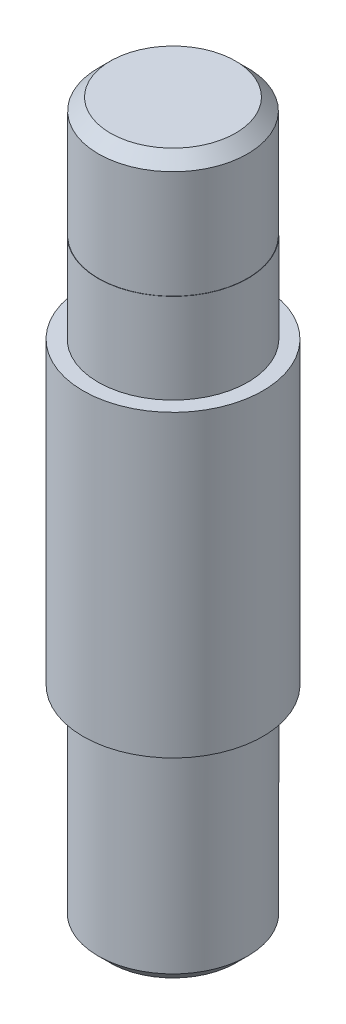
ISO-10303-21;
HEADER;
FILE_DESCRIPTION(('STEP AP214'),'2;1');
FILE_NAME('part.step','',(''),(''),'','','');
FILE_SCHEMA(('AUTOMOTIVE_DESIGN { 1 0 10303 214 1 1 1 1 }'));
ENDSEC;
DATA;
#1=APPLICATION_CONTEXT('core data for automotive mechanical design processes');
#2=APPLICATION_PROTOCOL_DEFINITION('international standard','automotive_design',2000,#1);
#3=PRODUCT_CONTEXT('',#1,'mechanical');
#4=PRODUCT('Part','Part','',(#3));
#5=PRODUCT_RELATED_PRODUCT_CATEGORY('part','',(#4));
#6=PRODUCT_DEFINITION_FORMATION('','',#4);
#7=PRODUCT_DEFINITION_CONTEXT('part definition',#1,'design');
#8=PRODUCT_DEFINITION('design','',#6,#7);
#9=PRODUCT_DEFINITION_SHAPE('','',#8);
#10=(LENGTH_UNIT() NAMED_UNIT(*) SI_UNIT(.MILLI.,.METRE.));
#11=(NAMED_UNIT(*) PLANE_ANGLE_UNIT() SI_UNIT($,.RADIAN.));
#12=(NAMED_UNIT(*) SI_UNIT($,.STERADIAN.) SOLID_ANGLE_UNIT());
#13=UNCERTAINTY_MEASURE_WITH_UNIT(LENGTH_MEASURE(1.E-05),#10,'distance_accuracy_value','');
#14=(GEOMETRIC_REPRESENTATION_CONTEXT(3) GLOBAL_UNCERTAINTY_ASSIGNED_CONTEXT((#13)) GLOBAL_UNIT_ASSIGNED_CONTEXT((#10,
#11,#12)) REPRESENTATION_CONTEXT('',''));
#15=CARTESIAN_POINT('',(0.,0.,0.));
#16=DIRECTION('',(0.,0.,1.));
#17=DIRECTION('',(1.,0.,0.));
#18=AXIS2_PLACEMENT_3D('',#15,#16,#17);
#19=CARTESIAN_POINT('',(0.,0.,0.));
#20=DIRECTION('',(0.,1.,0.));
#21=DIRECTION('',(0.,0.,1.));
#22=AXIS2_PLACEMENT_3D('',#19,#20,#21);
#23=PLANE('',#22);
#24=CARTESIAN_POINT('',(0.,0.,0.));
#25=DIRECTION('',(0.,1.,0.));
#26=DIRECTION('',(0.,0.,1.));
#27=AXIS2_PLACEMENT_3D('',#24,#25,#26);
#28=CIRCLE('',#27,3.);
#29=CARTESIAN_POINT('',(0.,0.,3.));
#30=VERTEX_POINT('',#29);
#31=EDGE_CURVE('E56',#30,#30,#28,.T.);
#32=ORIENTED_EDGE('',*,*,#31,.F.);
#33=EDGE_LOOP('',(#32));
#34=FACE_BOUND('',#33,.T.);
#35=CARTESIAN_POINT('',(0.,0.,0.));
#36=DIRECTION('',(0.,1.,0.));
#37=DIRECTION('',(0.,0.,1.));
#38=AXIS2_PLACEMENT_3D('',#35,#36,#37);
#39=CIRCLE('',#38,2.5);
#40=CARTESIAN_POINT('',(0.,0.,2.5));
#41=VERTEX_POINT('',#40);
#42=EDGE_CURVE('E50',#41,#41,#39,.F.);
#43=ORIENTED_EDGE('',*,*,#42,.F.);
#44=EDGE_LOOP('',(#43));
#45=FACE_BOUND('',#44,.T.);
#46=ADVANCED_FACE('F30',(#34,#45),#23,.F.);
#47=CARTESIAN_POINT('',(0.,13.,0.));
#48=DIRECTION('',(0.,1.,0.));
#49=DIRECTION('',(0.,0.,1.));
#50=AXIS2_PLACEMENT_3D('',#47,#48,#49);
#51=PLANE('',#50);
#52=CARTESIAN_POINT('',(0.,13.,0.));
#53=DIRECTION('',(0.,1.,0.));
#54=DIRECTION('',(0.,0.,1.));
#55=AXIS2_PLACEMENT_3D('',#52,#53,#54);
#56=CIRCLE('',#55,2.5);
#57=CARTESIAN_POINT('',(0.,13.,2.5));
#58=VERTEX_POINT('',#57);
#59=EDGE_CURVE('E59',#58,#58,#56,.T.);
#60=ORIENTED_EDGE('',*,*,#59,.T.);
#61=EDGE_LOOP('',(#60));
#62=FACE_BOUND('',#61,.T.);
#63=CARTESIAN_POINT('',(0.,13.,0.));
#64=DIRECTION('',(0.,1.,0.));
#65=DIRECTION('',(0.,0.,1.));
#66=AXIS2_PLACEMENT_3D('',#63,#64,#65);
#67=CIRCLE('',#66,2.49);
#68=CARTESIAN_POINT('',(0.,13.,2.49));
#69=VERTEX_POINT('',#68);
#70=EDGE_CURVE('E65',#69,#69,#67,.T.);
#71=ORIENTED_EDGE('',*,*,#70,.F.);
#72=EDGE_LOOP('',(#71));
#73=FACE_BOUND('',#72,.T.);
#74=ADVANCED_FACE('F71',(#62,#73),#51,.T.);
#75=CARTESIAN_POINT('',(0.,10.,0.));
#76=DIRECTION('',(0.,1.,0.));
#77=DIRECTION('',(0.,0.,1.));
#78=AXIS2_PLACEMENT_3D('',#75,#76,#77);
#79=PLANE('',#78);
#80=CARTESIAN_POINT('',(0.,10.,0.));
#81=DIRECTION('',(0.,1.,0.));
#82=DIRECTION('',(0.,0.,1.));
#83=AXIS2_PLACEMENT_3D('',#80,#81,#82);
#84=CIRCLE('',#83,3.);
#85=CARTESIAN_POINT('',(0.,10.,3.));
#86=VERTEX_POINT('',#85);
#87=EDGE_CURVE('E53',#86,#86,#84,.T.);
#88=ORIENTED_EDGE('',*,*,#87,.T.);
#89=EDGE_LOOP('',(#88));
#90=FACE_BOUND('',#89,.T.);
#91=CARTESIAN_POINT('',(0.,10.,0.));
#92=DIRECTION('',(0.,1.,0.));
#93=DIRECTION('',(0.,0.,1.));
#94=AXIS2_PLACEMENT_3D('',#91,#92,#93);
#95=CIRCLE('',#94,2.5);
#96=CARTESIAN_POINT('',(0.,10.,2.5));
#97=VERTEX_POINT('',#96);
#98=EDGE_CURVE('E62',#97,#97,#95,.T.);
#99=ORIENTED_EDGE('',*,*,#98,.F.);
#100=EDGE_LOOP('',(#99));
#101=FACE_BOUND('',#100,.T.);
#102=ADVANCED_FACE('F73',(#90,#101),#79,.T.);
#103=CARTESIAN_POINT('',(0.,10.,0.));
#104=DIRECTION('',(0.,-1.,0.));
#105=DIRECTION('',(0.,0.,-1.));
#106=AXIS2_PLACEMENT_3D('',#103,#104,#105);
#107=CYLINDRICAL_SURFACE('',#106,3.);
#108=ORIENTED_EDGE('',*,*,#87,.F.);
#109=EDGE_LOOP('',(#108));
#110=FACE_BOUND('',#109,.T.);
#111=ORIENTED_EDGE('',*,*,#31,.T.);
#112=EDGE_LOOP('',(#111));
#113=FACE_BOUND('',#112,.T.);
#114=ADVANCED_FACE('F32',(#110,#113),#107,.T.);
#115=CARTESIAN_POINT('',(0.,13.,0.));
#116=DIRECTION('',(0.,-1.,0.));
#117=DIRECTION('',(0.,0.,-1.));
#118=AXIS2_PLACEMENT_3D('',#115,#116,#117);
#119=CYLINDRICAL_SURFACE('',#118,2.5);
#120=ORIENTED_EDGE('',*,*,#59,.F.);
#121=EDGE_LOOP('',(#120));
#122=FACE_BOUND('',#121,.T.);
#123=ORIENTED_EDGE('',*,*,#98,.T.);
#124=EDGE_LOOP('',(#123));
#125=FACE_BOUND('',#124,.T.);
#126=ADVANCED_FACE('F86',(#122,#125),#119,.T.);
#127=CARTESIAN_POINT('',(0.,17.,0.));
#128=DIRECTION('',(0.,-1.,0.));
#129=DIRECTION('',(0.,0.,-1.));
#130=AXIS2_PLACEMENT_3D('',#127,#128,#129);
#131=CYLINDRICAL_SURFACE('',#130,2.49);
#132=CARTESIAN_POINT('',(0.,16.6,0.));
#133=DIRECTION('',(0.,1.,0.));
#134=DIRECTION('',(0.,0.,1.));
#135=AXIS2_PLACEMENT_3D('',#132,#133,#134);
#136=CIRCLE('',#135,2.49);
#137=CARTESIAN_POINT('',(0.,16.6,2.49));
#138=VERTEX_POINT('',#137);
#139=EDGE_CURVE('E10',#138,#138,#136,.F.);
#140=ORIENTED_EDGE('',*,*,#139,.T.);
#141=EDGE_LOOP('',(#140));
#142=FACE_BOUND('',#141,.T.);
#143=ORIENTED_EDGE('',*,*,#70,.T.);
#144=EDGE_LOOP('',(#143));
#145=FACE_BOUND('',#144,.T.);
#146=ADVANCED_FACE('F69',(#142,#145),#131,.T.);
#147=CARTESIAN_POINT('',(0.,17.,0.));
#148=DIRECTION('',(0.,1.,0.));
#149=DIRECTION('',(0.,0.,1.));
#150=AXIS2_PLACEMENT_3D('',#147,#148,#149);
#151=PLANE('',#150);
#152=CARTESIAN_POINT('',(0.,17.,0.));
#153=DIRECTION('',(0.,1.,0.));
#154=DIRECTION('',(0.,0.,1.));
#155=AXIS2_PLACEMENT_3D('',#152,#153,#154);
#156=CIRCLE('',#155,2.09);
#157=CARTESIAN_POINT('',(0.,17.,2.09));
#158=VERTEX_POINT('',#157);
#159=EDGE_CURVE('E37',#158,#158,#156,.T.);
#160=ORIENTED_EDGE('',*,*,#159,.T.);
#161=EDGE_LOOP('',(#160));
#162=FACE_BOUND('',#161,.T.);
#163=ADVANCED_FACE('F93',(#162),#151,.T.);
#164=CARTESIAN_POINT('',(0.,-7.,0.));
#165=DIRECTION('',(0.,1.,0.));
#166=DIRECTION('',(0.,0.,1.));
#167=AXIS2_PLACEMENT_3D('',#164,#165,#166);
#168=CYLINDRICAL_SURFACE('',#167,2.5);
#169=CARTESIAN_POINT('',(0.,-6.6,0.));
#170=DIRECTION('',(0.,-1.,0.));
#171=DIRECTION('',(0.,0.,-1.));
#172=AXIS2_PLACEMENT_3D('',#169,#170,#171);
#173=CIRCLE('',#172,2.5);
#174=CARTESIAN_POINT('',(0.,-6.6,-2.5));
#175=VERTEX_POINT('',#174);
#176=EDGE_CURVE('E41',#175,#175,#173,.F.);
#177=ORIENTED_EDGE('',*,*,#176,.T.);
#178=EDGE_LOOP('',(#177));
#179=FACE_BOUND('',#178,.T.);
#180=ORIENTED_EDGE('',*,*,#42,.T.);
#181=EDGE_LOOP('',(#180));
#182=FACE_BOUND('',#181,.T.);
#183=ADVANCED_FACE('F107',(#179,#182),#168,.T.);
#184=CARTESIAN_POINT('',(0.,-7.,0.));
#185=DIRECTION('',(0.,-1.,0.));
#186=DIRECTION('',(0.,0.,-1.));
#187=AXIS2_PLACEMENT_3D('',#184,#185,#186);
#188=PLANE('',#187);
#189=CARTESIAN_POINT('',(0.,-7.,0.));
#190=DIRECTION('',(0.,-1.,0.));
#191=DIRECTION('',(0.,0.,-1.));
#192=AXIS2_PLACEMENT_3D('',#189,#190,#191);
#193=CIRCLE('',#192,2.1);
#194=CARTESIAN_POINT('',(0.,-7.,-2.1));
#195=VERTEX_POINT('',#194);
#196=EDGE_CURVE('E45',#195,#195,#193,.T.);
#197=ORIENTED_EDGE('',*,*,#196,.T.);
#198=EDGE_LOOP('',(#197));
#199=FACE_BOUND('',#198,.T.);
#200=ADVANCED_FACE('F109',(#199),#188,.T.);
#201=CARTESIAN_POINT('',(0.,-7.,0.));
#202=DIRECTION('',(0.,1.,0.));
#203=DIRECTION('',(0.,0.,1.));
#204=AXIS2_PLACEMENT_3D('',#201,#202,#203);
#205=CONICAL_SURFACE('',#204,2.1,0.785398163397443);
#206=ORIENTED_EDGE('',*,*,#176,.F.);
#207=EDGE_LOOP('',(#206));
#208=FACE_BOUND('',#207,.T.);
#209=ORIENTED_EDGE('',*,*,#196,.F.);
#210=EDGE_LOOP('',(#209));
#211=FACE_BOUND('',#210,.T.);
#212=ADVANCED_FACE('F116',(#208,#211),#205,.T.);
#213=CARTESIAN_POINT('',(0.,17.,0.));
#214=DIRECTION('',(0.,-1.,0.));
#215=DIRECTION('',(0.,0.,-1.));
#216=AXIS2_PLACEMENT_3D('',#213,#214,#215);
#217=CONICAL_SURFACE('',#216,2.09,0.785398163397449);
#218=ORIENTED_EDGE('',*,*,#139,.F.);
#219=EDGE_LOOP('',(#218));
#220=FACE_BOUND('',#219,.T.);
#221=ORIENTED_EDGE('',*,*,#159,.F.);
#222=EDGE_LOOP('',(#221));
#223=FACE_BOUND('',#222,.T.);
#224=ADVANCED_FACE('F122',(#220,#223),#217,.T.);
#225=CLOSED_SHELL('',(#46,#74,#102,#114,#126,#146,#163,#183,#200,#212,#224));
#226=MANIFOLD_SOLID_BREP('B2',#225);
#227=ADVANCED_BREP_SHAPE_REPRESENTATION('',(#18,#226),#14);
#228=SHAPE_DEFINITION_REPRESENTATION(#9,#227);
ENDSEC;
END-ISO-10303-21;
